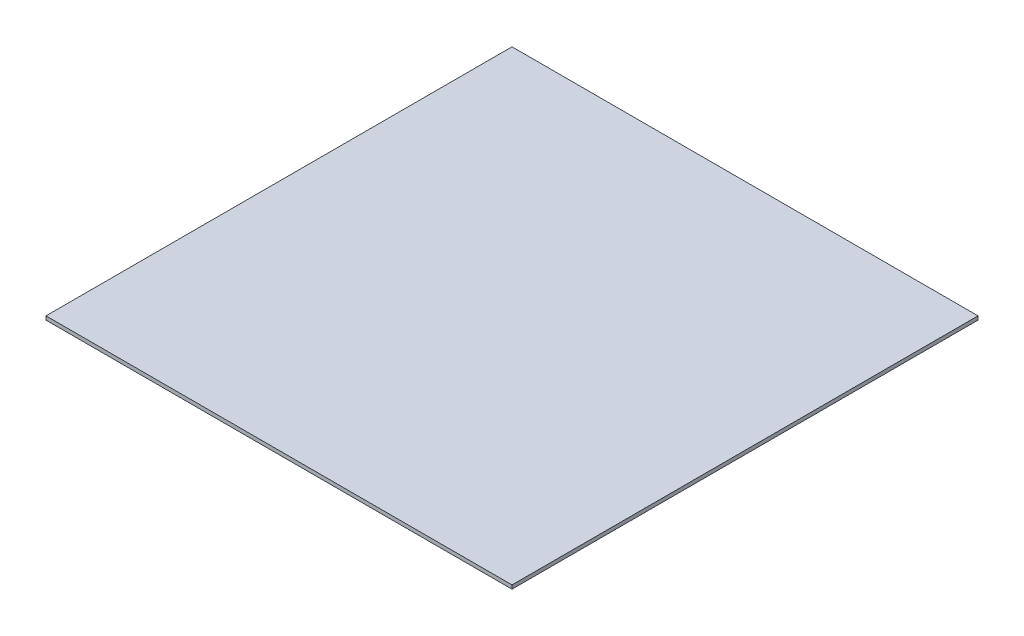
from build123d import *

# Parameters (mm, degrees)
SKETCH1_W           = 250
SKETCH1_H           = 250
BOSS_EXTRUDE1_DEPTH = 2


with BuildPart() as part:
    # Sketch1 → Boss-Extrude1 (new body)
    with BuildSketch(Plane(origin=(0, 0, 0), x_dir=(1, 0, 0), z_dir=(0, 1, 0))):
        Rectangle(SKETCH1_W, SKETCH1_H)
    extrude(amount=BOSS_EXTRUDE1_DEPTH)


solid = part.part
